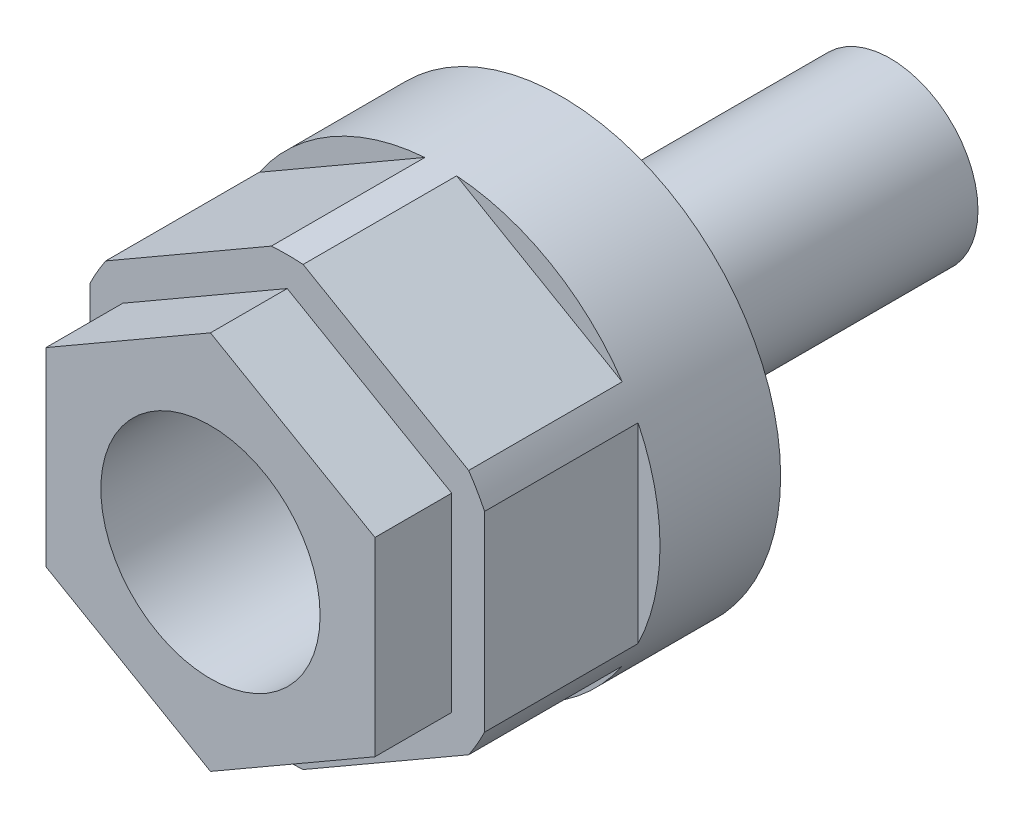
ISO-10303-21;
HEADER;
FILE_DESCRIPTION(('STEP AP214'),'2;1');
FILE_NAME('part.step','',(''),(''),'','','');
FILE_SCHEMA(('AUTOMOTIVE_DESIGN { 1 0 10303 214 1 1 1 1 }'));
ENDSEC;
DATA;
#1=APPLICATION_CONTEXT('core data for automotive mechanical design processes');
#2=APPLICATION_PROTOCOL_DEFINITION('international standard','automotive_design',2000,#1);
#3=PRODUCT_CONTEXT('',#1,'mechanical');
#4=PRODUCT('Part','Part','',(#3));
#5=PRODUCT_RELATED_PRODUCT_CATEGORY('part','',(#4));
#6=PRODUCT_DEFINITION_FORMATION('','',#4);
#7=PRODUCT_DEFINITION_CONTEXT('part definition',#1,'design');
#8=PRODUCT_DEFINITION('design','',#6,#7);
#9=PRODUCT_DEFINITION_SHAPE('','',#8);
#10=(LENGTH_UNIT() NAMED_UNIT(*) SI_UNIT(.MILLI.,.METRE.));
#11=(NAMED_UNIT(*) PLANE_ANGLE_UNIT() SI_UNIT($,.RADIAN.));
#12=(NAMED_UNIT(*) SI_UNIT($,.STERADIAN.) SOLID_ANGLE_UNIT());
#13=UNCERTAINTY_MEASURE_WITH_UNIT(LENGTH_MEASURE(1.E-05),#10,'distance_accuracy_value','');
#14=(GEOMETRIC_REPRESENTATION_CONTEXT(3) GLOBAL_UNCERTAINTY_ASSIGNED_CONTEXT((#13)) GLOBAL_UNIT_ASSIGNED_CONTEXT((#10,
#11,#12)) REPRESENTATION_CONTEXT('',''));
#15=CARTESIAN_POINT('',(0.,0.,0.));
#16=DIRECTION('',(0.,0.,1.));
#17=DIRECTION('',(1.,0.,0.));
#18=AXIS2_PLACEMENT_3D('',#15,#16,#17);
#19=CARTESIAN_POINT('',(0.,0.,80.));
#20=DIRECTION('',(0.,0.,1.));
#21=DIRECTION('',(1.,0.,0.));
#22=AXIS2_PLACEMENT_3D('',#19,#20,#21);
#23=CYLINDRICAL_SURFACE('',#22,20.);
#24=CARTESIAN_POINT('',(0.,0.,0.));
#25=DIRECTION('',(0.,0.,1.));
#26=DIRECTION('',(1.,0.,0.));
#27=AXIS2_PLACEMENT_3D('',#24,#25,#26);
#28=CIRCLE('',#27,20.);
#29=CARTESIAN_POINT('',(20.,0.,0.));
#30=VERTEX_POINT('',#29);
#31=EDGE_CURVE('E216',#30,#30,#28,.T.);
#32=ORIENTED_EDGE('',*,*,#31,.T.);
#33=EDGE_LOOP('',(#32));
#34=FACE_BOUND('',#33,.T.);
#35=DIRECTION('',(0.,0.,1.));
#36=VECTOR('',#35,1.);
#37=CARTESIAN_POINT('',(18.,-8.71779788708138,80.));
#38=LINE('',#37,#36);
#39=CARTESIAN_POINT('',(18.,-8.71779788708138,11.));
#40=VERTEX_POINT('',#39);
#41=CARTESIAN_POINT('',(18.,-8.71779788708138,25.));
#42=VERTEX_POINT('',#41);
#43=EDGE_CURVE('E269',#40,#42,#38,.T.);
#44=ORIENTED_EDGE('',*,*,#43,.T.);
#45=CARTESIAN_POINT('',(0.,0.,25.));
#46=DIRECTION('',(0.,0.,1.));
#47=DIRECTION('',(1.,0.,0.));
#48=AXIS2_PLACEMENT_3D('',#45,#46,#47);
#49=CIRCLE('',#48,20.);
#50=CARTESIAN_POINT('',(16.5498344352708,-11.2295583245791,25.));
#51=VERTEX_POINT('',#50);
#52=EDGE_CURVE('E206',#42,#51,#49,.F.);
#53=ORIENTED_EDGE('',*,*,#52,.T.);
#54=DIRECTION('',(0.,0.,1.));
#55=VECTOR('',#54,1.);
#56=CARTESIAN_POINT('',(16.5498344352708,-11.2295583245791,80.));
#57=LINE('',#56,#55);
#58=CARTESIAN_POINT('',(16.5498344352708,-11.2295583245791,11.));
#59=VERTEX_POINT('',#58);
#60=EDGE_CURVE('E263',#59,#51,#57,.T.);
#61=ORIENTED_EDGE('',*,*,#60,.F.);
#62=CARTESIAN_POINT('',(0.,0.,11.));
#63=DIRECTION('',(0.,0.,1.));
#64=DIRECTION('',(1.,0.,0.));
#65=AXIS2_PLACEMENT_3D('',#62,#63,#64);
#66=CIRCLE('',#65,20.);
#67=CARTESIAN_POINT('',(1.45016556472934,-19.9473562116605,11.));
#68=VERTEX_POINT('',#67);
#69=EDGE_CURVE('E266',#59,#68,#66,.F.);
#70=ORIENTED_EDGE('',*,*,#69,.T.);
#71=DIRECTION('',(0.,0.,1.));
#72=VECTOR('',#71,1.);
#73=CARTESIAN_POINT('',(1.45016556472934,-19.9473562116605,80.));
#74=LINE('',#73,#72);
#75=CARTESIAN_POINT('',(1.45016556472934,-19.9473562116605,25.));
#76=VERTEX_POINT('',#75);
#77=EDGE_CURVE('E267',#76,#68,#74,.F.);
#78=ORIENTED_EDGE('',*,*,#77,.F.);
#79=CARTESIAN_POINT('',(-1.45016556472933,-19.9473562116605,25.));
#80=VERTEX_POINT('',#79);
#81=EDGE_CURVE('E196',#76,#80,#49,.F.);
#82=ORIENTED_EDGE('',*,*,#81,.T.);
#83=DIRECTION('',(0.,0.,1.));
#84=VECTOR('',#83,1.);
#85=CARTESIAN_POINT('',(-1.45016556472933,-19.9473562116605,80.));
#86=LINE('',#85,#84);
#87=CARTESIAN_POINT('',(-1.45016556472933,-19.9473562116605,11.));
#88=VERTEX_POINT('',#87);
#89=EDGE_CURVE('E261',#80,#88,#86,.F.);
#90=ORIENTED_EDGE('',*,*,#89,.T.);
#91=CARTESIAN_POINT('',(-16.5498344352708,-11.2295583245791,11.));
#92=VERTEX_POINT('',#91);
#93=EDGE_CURVE('E260',#88,#92,#66,.F.);
#94=ORIENTED_EDGE('',*,*,#93,.T.);
#95=DIRECTION('',(0.,0.,1.));
#96=VECTOR('',#95,1.);
#97=CARTESIAN_POINT('',(-16.5498344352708,-11.2295583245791,80.));
#98=LINE('',#97,#96);
#99=CARTESIAN_POINT('',(-16.5498344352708,-11.2295583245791,25.));
#100=VERTEX_POINT('',#99);
#101=EDGE_CURVE('E257',#92,#100,#98,.T.);
#102=ORIENTED_EDGE('',*,*,#101,.T.);
#103=CARTESIAN_POINT('',(-18.,-8.71779788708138,25.));
#104=VERTEX_POINT('',#103);
#105=EDGE_CURVE('E208',#100,#104,#49,.F.);
#106=ORIENTED_EDGE('',*,*,#105,.T.);
#107=DIRECTION('',(0.,0.,1.));
#108=VECTOR('',#107,1.);
#109=CARTESIAN_POINT('',(-18.,-8.71779788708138,80.));
#110=LINE('',#109,#108);
#111=CARTESIAN_POINT('',(-18.,-8.71779788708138,11.));
#112=VERTEX_POINT('',#111);
#113=EDGE_CURVE('E252',#112,#104,#110,.T.);
#114=ORIENTED_EDGE('',*,*,#113,.F.);
#115=CARTESIAN_POINT('',(-18.,8.71779788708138,11.));
#116=VERTEX_POINT('',#115);
#117=EDGE_CURVE('E250',#112,#116,#66,.F.);
#118=ORIENTED_EDGE('',*,*,#117,.T.);
#119=DIRECTION('',(0.,0.,1.));
#120=VECTOR('',#119,1.);
#121=CARTESIAN_POINT('',(-18.,8.71779788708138,80.));
#122=LINE('',#121,#120);
#123=CARTESIAN_POINT('',(-18.,8.71779788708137,25.));
#124=VERTEX_POINT('',#123);
#125=EDGE_CURVE('E255',#124,#116,#122,.F.);
#126=ORIENTED_EDGE('',*,*,#125,.F.);
#127=CARTESIAN_POINT('',(-16.5498344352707,11.2295583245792,25.));
#128=VERTEX_POINT('',#127);
#129=EDGE_CURVE('E202',#124,#128,#49,.F.);
#130=ORIENTED_EDGE('',*,*,#129,.T.);
#131=DIRECTION('',(0.,0.,1.));
#132=VECTOR('',#131,1.);
#133=CARTESIAN_POINT('',(-16.5498344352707,11.2295583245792,80.));
#134=LINE('',#133,#132);
#135=CARTESIAN_POINT('',(-16.5498344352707,11.2295583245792,11.));
#136=VERTEX_POINT('',#135);
#137=EDGE_CURVE('E242',#136,#128,#134,.T.);
#138=ORIENTED_EDGE('',*,*,#137,.F.);
#139=CARTESIAN_POINT('',(-1.45016556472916,19.9473562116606,11.));
#140=VERTEX_POINT('',#139);
#141=EDGE_CURVE('E245',#136,#140,#66,.F.);
#142=ORIENTED_EDGE('',*,*,#141,.T.);
#143=DIRECTION('',(0.,0.,1.));
#144=VECTOR('',#143,1.);
#145=CARTESIAN_POINT('',(-1.45016556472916,19.9473562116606,80.));
#146=LINE('',#145,#144);
#147=CARTESIAN_POINT('',(-1.45016556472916,19.9473562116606,25.));
#148=VERTEX_POINT('',#147);
#149=EDGE_CURVE('E248',#148,#140,#146,.F.);
#150=ORIENTED_EDGE('',*,*,#149,.F.);
#151=CARTESIAN_POINT('',(1.45016556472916,19.9473562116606,25.));
#152=VERTEX_POINT('',#151);
#153=EDGE_CURVE('E195',#148,#152,#49,.F.);
#154=ORIENTED_EDGE('',*,*,#153,.T.);
#155=DIRECTION('',(0.,0.,1.));
#156=VECTOR('',#155,1.);
#157=CARTESIAN_POINT('',(1.45016556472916,19.9473562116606,80.));
#158=LINE('',#157,#156);
#159=CARTESIAN_POINT('',(1.45016556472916,19.9473562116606,11.));
#160=VERTEX_POINT('',#159);
#161=EDGE_CURVE('E23',#152,#160,#158,.F.);
#162=ORIENTED_EDGE('',*,*,#161,.T.);
#163=CARTESIAN_POINT('',(16.5498344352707,11.2295583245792,11.));
#164=VERTEX_POINT('',#163);
#165=EDGE_CURVE('E249',#160,#164,#66,.F.);
#166=ORIENTED_EDGE('',*,*,#165,.T.);
#167=DIRECTION('',(0.,0.,1.));
#168=VECTOR('',#167,1.);
#169=CARTESIAN_POINT('',(16.5498344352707,11.2295583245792,80.));
#170=LINE('',#169,#168);
#171=CARTESIAN_POINT('',(16.5498344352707,11.2295583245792,25.));
#172=VERTEX_POINT('',#171);
#173=EDGE_CURVE('E275',#164,#172,#170,.T.);
#174=ORIENTED_EDGE('',*,*,#173,.T.);
#175=CARTESIAN_POINT('',(18.,8.71779788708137,25.));
#176=VERTEX_POINT('',#175);
#177=EDGE_CURVE('E38',#172,#176,#49,.F.);
#178=ORIENTED_EDGE('',*,*,#177,.T.);
#179=DIRECTION('',(0.,0.,1.));
#180=VECTOR('',#179,1.);
#181=CARTESIAN_POINT('',(18.,8.71779788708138,80.));
#182=LINE('',#181,#180);
#183=CARTESIAN_POINT('',(18.,8.71779788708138,11.));
#184=VERTEX_POINT('',#183);
#185=EDGE_CURVE('E273',#176,#184,#182,.F.);
#186=ORIENTED_EDGE('',*,*,#185,.T.);
#187=EDGE_CURVE('E272',#184,#40,#66,.F.);
#188=ORIENTED_EDGE('',*,*,#187,.T.);
#189=EDGE_LOOP('',(#44,#53,#61,#70,#78,#82,#90,#94,#102,#106,#114,#118,#126,#130,#138,#142,#150,
#154,#162,#166,#174,#178,#186,#188));
#190=FACE_BOUND('',#189,.T.);
#191=ADVANCED_FACE('F14',(#34,#190),#23,.T.);
#192=CARTESIAN_POINT('',(-18.,10.3923048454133,11.));
#193=DIRECTION('',(0.5,-0.86602540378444,0.));
#194=DIRECTION('',(0.86602540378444,0.5,0.));
#195=AXIS2_PLACEMENT_3D('',#192,#193,#194);
#196=PLANE('',#195);
#197=DIRECTION('',(-0.86602540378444,-0.5,0.));
#198=VECTOR('',#197,1.);
#199=CARTESIAN_POINT('',(-18.,10.3923048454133,25.));
#200=LINE('',#199,#198);
#201=EDGE_CURVE('E200',#148,#128,#200,.T.);
#202=ORIENTED_EDGE('',*,*,#201,.F.);
#203=ORIENTED_EDGE('',*,*,#149,.T.);
#204=DIRECTION('',(0.86602540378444,0.5,0.));
#205=VECTOR('',#204,1.);
#206=CARTESIAN_POINT('',(-18.,10.3923048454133,11.));
#207=LINE('',#206,#205);
#208=EDGE_CURVE('E226',#136,#140,#207,.T.);
#209=ORIENTED_EDGE('',*,*,#208,.F.);
#210=ORIENTED_EDGE('',*,*,#137,.T.);
#211=EDGE_LOOP('',(#202,#203,#209,#210));
#212=FACE_BOUND('',#211,.T.);
#213=ADVANCED_FACE('F333',(#212),#196,.F.);
#214=CARTESIAN_POINT('',(-18.,-10.3923048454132,11.));
#215=DIRECTION('',(1.,0.,0.));
#216=DIRECTION('',(0.,0.,-1.));
#217=AXIS2_PLACEMENT_3D('',#214,#215,#216);
#218=PLANE('',#217);
#219=DIRECTION('',(0.,-1.,0.));
#220=VECTOR('',#219,1.);
#221=CARTESIAN_POINT('',(-18.,-10.3923048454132,25.));
#222=LINE('',#221,#220);
#223=EDGE_CURVE('E205',#124,#104,#222,.T.);
#224=ORIENTED_EDGE('',*,*,#223,.F.);
#225=ORIENTED_EDGE('',*,*,#125,.T.);
#226=DIRECTION('',(0.,1.,0.));
#227=VECTOR('',#226,1.);
#228=CARTESIAN_POINT('',(-18.,-10.3923048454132,11.));
#229=LINE('',#228,#227);
#230=EDGE_CURVE('E223',#112,#116,#229,.T.);
#231=ORIENTED_EDGE('',*,*,#230,.F.);
#232=ORIENTED_EDGE('',*,*,#113,.T.);
#233=EDGE_LOOP('',(#224,#225,#231,#232));
#234=FACE_BOUND('',#233,.T.);
#235=ADVANCED_FACE('F301',(#234),#218,.F.);
#236=CARTESIAN_POINT('',(-18.,-10.3923048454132,11.));
#237=DIRECTION('',(-0.5,-0.866025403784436,0.));
#238=DIRECTION('',(0.866025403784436,-0.5,0.));
#239=AXIS2_PLACEMENT_3D('',#236,#237,#238);
#240=PLANE('',#239);
#241=ORIENTED_EDGE('',*,*,#89,.F.);
#242=DIRECTION('',(-0.866025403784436,0.5,0.));
#243=VECTOR('',#242,1.);
#244=CARTESIAN_POINT('',(-18.,-10.3923048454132,25.));
#245=LINE('',#244,#243);
#246=EDGE_CURVE('E209',#80,#100,#245,.T.);
#247=ORIENTED_EDGE('',*,*,#246,.T.);
#248=ORIENTED_EDGE('',*,*,#101,.F.);
#249=DIRECTION('',(0.866025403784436,-0.5,0.));
#250=VECTOR('',#249,1.);
#251=CARTESIAN_POINT('',(-18.,-10.3923048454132,11.));
#252=LINE('',#251,#250);
#253=EDGE_CURVE('E220',#92,#88,#252,.T.);
#254=ORIENTED_EDGE('',*,*,#253,.T.);
#255=EDGE_LOOP('',(#241,#247,#248,#254));
#256=FACE_BOUND('',#255,.T.);
#257=ADVANCED_FACE('F398',(#256),#240,.T.);
#258=CARTESIAN_POINT('',(18.,-10.3923048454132,11.));
#259=DIRECTION('',(-0.5,0.866025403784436,0.));
#260=DIRECTION('',(-0.866025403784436,-0.5,0.));
#261=AXIS2_PLACEMENT_3D('',#258,#259,#260);
#262=PLANE('',#261);
#263=DIRECTION('',(0.866025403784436,0.5,0.));
#264=VECTOR('',#263,1.);
#265=CARTESIAN_POINT('',(18.,-10.3923048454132,25.));
#266=LINE('',#265,#264);
#267=EDGE_CURVE('E203',#76,#51,#266,.T.);
#268=ORIENTED_EDGE('',*,*,#267,.F.);
#269=ORIENTED_EDGE('',*,*,#77,.T.);
#270=DIRECTION('',(-0.866025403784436,-0.5,0.));
#271=VECTOR('',#270,1.);
#272=CARTESIAN_POINT('',(18.,-10.3923048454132,11.));
#273=LINE('',#272,#271);
#274=EDGE_CURVE('E217',#59,#68,#273,.T.);
#275=ORIENTED_EDGE('',*,*,#274,.F.);
#276=ORIENTED_EDGE('',*,*,#60,.T.);
#277=EDGE_LOOP('',(#268,#269,#275,#276));
#278=FACE_BOUND('',#277,.T.);
#279=ADVANCED_FACE('F401',(#278),#262,.F.);
#280=CARTESIAN_POINT('',(18.,-10.3923048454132,11.));
#281=DIRECTION('',(1.,0.,0.));
#282=DIRECTION('',(0.,0.,-1.));
#283=AXIS2_PLACEMENT_3D('',#280,#281,#282);
#284=PLANE('',#283);
#285=ORIENTED_EDGE('',*,*,#185,.F.);
#286=DIRECTION('',(0.,-1.,0.));
#287=VECTOR('',#286,1.);
#288=CARTESIAN_POINT('',(18.,-10.3923048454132,25.));
#289=LINE('',#288,#287);
#290=EDGE_CURVE('E197',#176,#42,#289,.T.);
#291=ORIENTED_EDGE('',*,*,#290,.T.);
#292=ORIENTED_EDGE('',*,*,#43,.F.);
#293=DIRECTION('',(0.,1.,0.));
#294=VECTOR('',#293,1.);
#295=CARTESIAN_POINT('',(18.,-10.3923048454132,11.));
#296=LINE('',#295,#294);
#297=EDGE_CURVE('E213',#40,#184,#296,.T.);
#298=ORIENTED_EDGE('',*,*,#297,.T.);
#299=EDGE_LOOP('',(#285,#291,#292,#298));
#300=FACE_BOUND('',#299,.T.);
#301=ADVANCED_FACE('F394',(#300),#284,.T.);
#302=CARTESIAN_POINT('',(18.,10.3923048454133,11.));
#303=DIRECTION('',(0.5,0.86602540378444,0.));
#304=DIRECTION('',(-0.86602540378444,0.5,0.));
#305=AXIS2_PLACEMENT_3D('',#302,#303,#304);
#306=PLANE('',#305);
#307=ORIENTED_EDGE('',*,*,#161,.F.);
#308=DIRECTION('',(0.86602540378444,-0.5,0.));
#309=VECTOR('',#308,1.);
#310=CARTESIAN_POINT('',(18.,10.3923048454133,25.));
#311=LINE('',#310,#309);
#312=EDGE_CURVE('E9',#152,#172,#311,.T.);
#313=ORIENTED_EDGE('',*,*,#312,.T.);
#314=ORIENTED_EDGE('',*,*,#173,.F.);
#315=DIRECTION('',(-0.86602540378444,0.5,0.));
#316=VECTOR('',#315,1.);
#317=CARTESIAN_POINT('',(18.,10.3923048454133,11.));
#318=LINE('',#317,#316);
#319=EDGE_CURVE('E212',#164,#160,#318,.T.);
#320=ORIENTED_EDGE('',*,*,#319,.T.);
#321=EDGE_LOOP('',(#307,#313,#314,#320));
#322=FACE_BOUND('',#321,.T.);
#323=ADVANCED_FACE('F310',(#322),#306,.T.);
#324=CARTESIAN_POINT('',(0.,0.,80.));
#325=DIRECTION('',(0.,0.,1.));
#326=DIRECTION('',(1.,0.,0.));
#327=AXIS2_PLACEMENT_3D('',#324,#325,#326);
#328=CYLINDRICAL_SURFACE('',#327,8.);
#329=CARTESIAN_POINT('',(0.,0.,-30.));
#330=DIRECTION('',(0.,0.,1.));
#331=DIRECTION('',(0.,-1.,0.));
#332=AXIS2_PLACEMENT_3D('',#329,#330,#331);
#333=CIRCLE('',#332,8.);
#334=CARTESIAN_POINT('',(0.,-8.,-30.));
#335=VERTEX_POINT('',#334);
#336=EDGE_CURVE('E18',#335,#335,#333,.F.);
#337=ORIENTED_EDGE('',*,*,#336,.F.);
#338=EDGE_LOOP('',(#337));
#339=FACE_BOUND('',#338,.T.);
#340=CARTESIAN_POINT('',(0.,0.,0.));
#341=DIRECTION('',(0.,0.,1.));
#342=DIRECTION('',(1.,0.,0.));
#343=AXIS2_PLACEMENT_3D('',#340,#341,#342);
#344=CIRCLE('',#343,8.);
#345=CARTESIAN_POINT('',(8.,0.,0.));
#346=VERTEX_POINT('',#345);
#347=EDGE_CURVE('E233',#346,#346,#344,.T.);
#348=ORIENTED_EDGE('',*,*,#347,.F.);
#349=EDGE_LOOP('',(#348));
#350=FACE_BOUND('',#349,.T.);
#351=ADVANCED_FACE('F344',(#339,#350),#328,.T.);
#352=CARTESIAN_POINT('',(20.,0.,0.));
#353=DIRECTION('',(0.,0.,-1.));
#354=DIRECTION('',(-1.,0.,0.));
#355=AXIS2_PLACEMENT_3D('',#352,#353,#354);
#356=PLANE('',#355);
#357=ORIENTED_EDGE('',*,*,#347,.T.);
#358=EDGE_LOOP('',(#357));
#359=FACE_BOUND('',#358,.T.);
#360=ORIENTED_EDGE('',*,*,#31,.F.);
#361=EDGE_LOOP('',(#360));
#362=FACE_BOUND('',#361,.T.);
#363=ADVANCED_FACE('F330',(#359,#362),#356,.T.);
#364=CARTESIAN_POINT('',(0.,0.,11.));
#365=DIRECTION('',(0.,0.,1.));
#366=DIRECTION('',(1.,0.,0.));
#367=AXIS2_PLACEMENT_3D('',#364,#365,#366);
#368=PLANE('',#367);
#369=ORIENTED_EDGE('',*,*,#208,.T.);
#370=ORIENTED_EDGE('',*,*,#141,.F.);
#371=EDGE_LOOP('',(#369,#370));
#372=FACE_BOUND('',#371,.T.);
#373=ADVANCED_FACE('F317',(#372),#368,.T.);
#374=ORIENTED_EDGE('',*,*,#230,.T.);
#375=ORIENTED_EDGE('',*,*,#117,.F.);
#376=EDGE_LOOP('',(#374,#375));
#377=FACE_BOUND('',#376,.T.);
#378=ADVANCED_FACE('F298',(#377),#368,.T.);
#379=ORIENTED_EDGE('',*,*,#253,.F.);
#380=ORIENTED_EDGE('',*,*,#93,.F.);
#381=EDGE_LOOP('',(#379,#380));
#382=FACE_BOUND('',#381,.T.);
#383=ADVANCED_FACE('F416',(#382),#368,.T.);
#384=ORIENTED_EDGE('',*,*,#274,.T.);
#385=ORIENTED_EDGE('',*,*,#69,.F.);
#386=EDGE_LOOP('',(#384,#385));
#387=FACE_BOUND('',#386,.T.);
#388=ADVANCED_FACE('F325',(#387),#368,.T.);
#389=ORIENTED_EDGE('',*,*,#297,.F.);
#390=ORIENTED_EDGE('',*,*,#187,.F.);
#391=EDGE_LOOP('',(#389,#390));
#392=FACE_BOUND('',#391,.T.);
#393=ADVANCED_FACE('F315',(#392),#368,.T.);
#394=ORIENTED_EDGE('',*,*,#319,.F.);
#395=ORIENTED_EDGE('',*,*,#165,.F.);
#396=EDGE_LOOP('',(#394,#395));
#397=FACE_BOUND('',#396,.T.);
#398=ADVANCED_FACE('F313',(#397),#368,.T.);
#399=CARTESIAN_POINT('',(0.,0.,25.));
#400=DIRECTION('',(0.,0.,1.));
#401=DIRECTION('',(1.,0.,0.));
#402=AXIS2_PLACEMENT_3D('',#399,#400,#401);
#403=PLANE('',#402);
#404=ORIENTED_EDGE('',*,*,#81,.F.);
#405=ORIENTED_EDGE('',*,*,#267,.T.);
#406=ORIENTED_EDGE('',*,*,#52,.F.);
#407=ORIENTED_EDGE('',*,*,#290,.F.);
#408=ORIENTED_EDGE('',*,*,#177,.F.);
#409=ORIENTED_EDGE('',*,*,#312,.F.);
#410=ORIENTED_EDGE('',*,*,#153,.F.);
#411=ORIENTED_EDGE('',*,*,#201,.T.);
#412=ORIENTED_EDGE('',*,*,#129,.F.);
#413=ORIENTED_EDGE('',*,*,#223,.T.);
#414=ORIENTED_EDGE('',*,*,#105,.F.);
#415=ORIENTED_EDGE('',*,*,#246,.F.);
#416=EDGE_LOOP('',(#404,#405,#406,#407,#408,#409,#410,#411,#412,#413,#414,#415));
#417=FACE_BOUND('',#416,.T.);
#418=DIRECTION('',(-0.866025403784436,-0.5,0.));
#419=VECTOR('',#418,1.);
#420=CARTESIAN_POINT('',(15.,-8.66025403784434,25.));
#421=LINE('',#420,#419);
#422=CARTESIAN_POINT('',(15.,-8.66025403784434,25.));
#423=VERTEX_POINT('',#422);
#424=CARTESIAN_POINT('',(0.,-17.3205080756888,25.));
#425=VERTEX_POINT('',#424);
#426=EDGE_CURVE('E183',#423,#425,#421,.T.);
#427=ORIENTED_EDGE('',*,*,#426,.T.);
#428=DIRECTION('',(0.866025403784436,-0.5,0.));
#429=VECTOR('',#428,1.);
#430=CARTESIAN_POINT('',(-15.,-8.66025403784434,25.));
#431=LINE('',#430,#429);
#432=CARTESIAN_POINT('',(-15.,-8.66025403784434,25.));
#433=VERTEX_POINT('',#432);
#434=EDGE_CURVE('E147',#433,#425,#431,.T.);
#435=ORIENTED_EDGE('',*,*,#434,.F.);
#436=DIRECTION('',(0.,1.,0.));
#437=VECTOR('',#436,1.);
#438=CARTESIAN_POINT('',(-15.,-8.66025403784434,25.));
#439=LINE('',#438,#437);
#440=CARTESIAN_POINT('',(-15.,8.66025403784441,25.));
#441=VERTEX_POINT('',#440);
#442=EDGE_CURVE('E179',#433,#441,#439,.T.);
#443=ORIENTED_EDGE('',*,*,#442,.T.);
#444=DIRECTION('',(0.866025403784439,0.5,0.));
#445=VECTOR('',#444,1.);
#446=CARTESIAN_POINT('',(-15.,8.66025403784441,25.));
#447=LINE('',#446,#445);
#448=CARTESIAN_POINT('',(0.,17.3205080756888,25.));
#449=VERTEX_POINT('',#448);
#450=EDGE_CURVE('E176',#441,#449,#447,.T.);
#451=ORIENTED_EDGE('',*,*,#450,.T.);
#452=DIRECTION('',(-0.866025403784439,0.5,0.));
#453=VECTOR('',#452,1.);
#454=CARTESIAN_POINT('',(15.,8.66025403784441,25.));
#455=LINE('',#454,#453);
#456=CARTESIAN_POINT('',(15.,8.66025403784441,25.));
#457=VERTEX_POINT('',#456);
#458=EDGE_CURVE('E173',#457,#449,#455,.T.);
#459=ORIENTED_EDGE('',*,*,#458,.F.);
#460=DIRECTION('',(0.,1.,0.));
#461=VECTOR('',#460,1.);
#462=CARTESIAN_POINT('',(15.,-8.66025403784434,25.));
#463=LINE('',#462,#461);
#464=EDGE_CURVE('E170',#423,#457,#463,.T.);
#465=ORIENTED_EDGE('',*,*,#464,.F.);
#466=EDGE_LOOP('',(#427,#435,#443,#451,#459,#465));
#467=FACE_BOUND('',#466,.T.);
#468=ADVANCED_FACE('F302',(#417,#467),#403,.T.);
#469=CARTESIAN_POINT('',(15.,-8.66025403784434,25.));
#470=DIRECTION('',(-0.5,0.866025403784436,0.));
#471=DIRECTION('',(-0.866025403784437,-0.5,0.));
#472=AXIS2_PLACEMENT_3D('',#469,#470,#471);
#473=PLANE('',#472);
#474=DIRECTION('',(0.,0.,1.));
#475=VECTOR('',#474,1.);
#476=CARTESIAN_POINT('',(0.,-17.3205080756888,25.));
#477=LINE('',#476,#475);
#478=CARTESIAN_POINT('',(0.,-17.3205080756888,32.));
#479=VERTEX_POINT('',#478);
#480=EDGE_CURVE('E140',#425,#479,#477,.T.);
#481=ORIENTED_EDGE('',*,*,#480,.F.);
#482=ORIENTED_EDGE('',*,*,#426,.F.);
#483=DIRECTION('',(0.,0.,1.));
#484=VECTOR('',#483,1.);
#485=CARTESIAN_POINT('',(15.,-8.66025403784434,25.));
#486=LINE('',#485,#484);
#487=CARTESIAN_POINT('',(15.,-8.66025403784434,32.));
#488=VERTEX_POINT('',#487);
#489=EDGE_CURVE('E156',#423,#488,#486,.T.);
#490=ORIENTED_EDGE('',*,*,#489,.T.);
#491=DIRECTION('',(-0.866025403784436,-0.5,0.));
#492=VECTOR('',#491,1.);
#493=CARTESIAN_POINT('',(15.,-8.66025403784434,32.));
#494=LINE('',#493,#492);
#495=EDGE_CURVE('E154',#488,#479,#494,.T.);
#496=ORIENTED_EDGE('',*,*,#495,.T.);
#497=EDGE_LOOP('',(#481,#482,#490,#496));
#498=FACE_BOUND('',#497,.T.);
#499=ADVANCED_FACE('F155',(#498),#473,.F.);
#500=CARTESIAN_POINT('',(-15.,-8.66025403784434,25.));
#501=DIRECTION('',(-0.5,-0.866025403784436,0.));
#502=DIRECTION('',(0.866025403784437,-0.5,0.));
#503=AXIS2_PLACEMENT_3D('',#500,#501,#502);
#504=PLANE('',#503);
#505=DIRECTION('',(0.,0.,1.));
#506=VECTOR('',#505,1.);
#507=CARTESIAN_POINT('',(-15.,-8.66025403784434,25.));
#508=LINE('',#507,#506);
#509=CARTESIAN_POINT('',(-15.,-8.66025403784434,32.));
#510=VERTEX_POINT('',#509);
#511=EDGE_CURVE('E151',#433,#510,#508,.T.);
#512=ORIENTED_EDGE('',*,*,#511,.F.);
#513=ORIENTED_EDGE('',*,*,#434,.T.);
#514=ORIENTED_EDGE('',*,*,#480,.T.);
#515=DIRECTION('',(0.866025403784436,-0.5,0.));
#516=VECTOR('',#515,1.);
#517=CARTESIAN_POINT('',(-15.,-8.66025403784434,32.));
#518=LINE('',#517,#516);
#519=EDGE_CURVE('E144',#510,#479,#518,.T.);
#520=ORIENTED_EDGE('',*,*,#519,.F.);
#521=EDGE_LOOP('',(#512,#513,#514,#520));
#522=FACE_BOUND('',#521,.T.);
#523=ADVANCED_FACE('F142',(#522),#504,.T.);
#524=CARTESIAN_POINT('',(-15.,-8.66025403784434,25.));
#525=DIRECTION('',(1.,0.,0.));
#526=DIRECTION('',(0.,0.,-1.));
#527=AXIS2_PLACEMENT_3D('',#524,#525,#526);
#528=PLANE('',#527);
#529=DIRECTION('',(0.,0.,1.));
#530=VECTOR('',#529,1.);
#531=CARTESIAN_POINT('',(-15.,8.66025403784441,25.));
#532=LINE('',#531,#530);
#533=CARTESIAN_POINT('',(-15.,8.66025403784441,32.));
#534=VERTEX_POINT('',#533);
#535=EDGE_CURVE('E191',#441,#534,#532,.T.);
#536=ORIENTED_EDGE('',*,*,#535,.F.);
#537=ORIENTED_EDGE('',*,*,#442,.F.);
#538=ORIENTED_EDGE('',*,*,#511,.T.);
#539=DIRECTION('',(0.,1.,0.));
#540=VECTOR('',#539,1.);
#541=CARTESIAN_POINT('',(-15.,-8.66025403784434,32.));
#542=LINE('',#541,#540);
#543=EDGE_CURVE('E164',#510,#534,#542,.T.);
#544=ORIENTED_EDGE('',*,*,#543,.T.);
#545=EDGE_LOOP('',(#536,#537,#538,#544));
#546=FACE_BOUND('',#545,.T.);
#547=ADVANCED_FACE('F386',(#546),#528,.F.);
#548=CARTESIAN_POINT('',(-15.,8.66025403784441,25.));
#549=DIRECTION('',(0.5,-0.86602540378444,0.));
#550=DIRECTION('',(0.86602540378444,0.5,0.));
#551=AXIS2_PLACEMENT_3D('',#548,#549,#550);
#552=PLANE('',#551);
#553=DIRECTION('',(0.,0.,1.));
#554=VECTOR('',#553,1.);
#555=CARTESIAN_POINT('',(0.,17.3205080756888,25.));
#556=LINE('',#555,#554);
#557=CARTESIAN_POINT('',(0.,17.3205080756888,32.));
#558=VERTEX_POINT('',#557);
#559=EDGE_CURVE('E189',#449,#558,#556,.T.);
#560=ORIENTED_EDGE('',*,*,#559,.F.);
#561=ORIENTED_EDGE('',*,*,#450,.F.);
#562=ORIENTED_EDGE('',*,*,#535,.T.);
#563=DIRECTION('',(0.866025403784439,0.5,0.));
#564=VECTOR('',#563,1.);
#565=CARTESIAN_POINT('',(-15.,8.66025403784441,32.));
#566=LINE('',#565,#564);
#567=EDGE_CURVE('E166',#534,#558,#566,.T.);
#568=ORIENTED_EDGE('',*,*,#567,.T.);
#569=EDGE_LOOP('',(#560,#561,#562,#568));
#570=FACE_BOUND('',#569,.T.);
#571=ADVANCED_FACE('F383',(#570),#552,.F.);
#572=CARTESIAN_POINT('',(15.,8.66025403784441,25.));
#573=DIRECTION('',(0.5,0.866025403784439,0.));
#574=DIRECTION('',(-0.86602540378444,0.5,0.));
#575=AXIS2_PLACEMENT_3D('',#572,#573,#574);
#576=PLANE('',#575);
#577=DIRECTION('',(0.,0.,1.));
#578=VECTOR('',#577,1.);
#579=CARTESIAN_POINT('',(15.,8.66025403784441,25.));
#580=LINE('',#579,#578);
#581=CARTESIAN_POINT('',(15.,8.66025403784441,32.));
#582=VERTEX_POINT('',#581);
#583=EDGE_CURVE('E187',#457,#582,#580,.T.);
#584=ORIENTED_EDGE('',*,*,#583,.F.);
#585=ORIENTED_EDGE('',*,*,#458,.T.);
#586=ORIENTED_EDGE('',*,*,#559,.T.);
#587=DIRECTION('',(-0.866025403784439,0.5,0.));
#588=VECTOR('',#587,1.);
#589=CARTESIAN_POINT('',(15.,8.66025403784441,32.));
#590=LINE('',#589,#588);
#591=EDGE_CURVE('E30',#582,#558,#590,.T.);
#592=ORIENTED_EDGE('',*,*,#591,.F.);
#593=EDGE_LOOP('',(#584,#585,#586,#592));
#594=FACE_BOUND('',#593,.T.);
#595=ADVANCED_FACE('F379',(#594),#576,.T.);
#596=CARTESIAN_POINT('',(15.,-8.66025403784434,25.));
#597=DIRECTION('',(1.,0.,0.));
#598=DIRECTION('',(0.,0.,-1.));
#599=AXIS2_PLACEMENT_3D('',#596,#597,#598);
#600=PLANE('',#599);
#601=ORIENTED_EDGE('',*,*,#464,.T.);
#602=ORIENTED_EDGE('',*,*,#583,.T.);
#603=DIRECTION('',(0.,1.,0.));
#604=VECTOR('',#603,1.);
#605=CARTESIAN_POINT('',(15.,-8.66025403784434,32.));
#606=LINE('',#605,#604);
#607=EDGE_CURVE('E185',#488,#582,#606,.T.);
#608=ORIENTED_EDGE('',*,*,#607,.F.);
#609=ORIENTED_EDGE('',*,*,#489,.F.);
#610=EDGE_LOOP('',(#601,#602,#608,#609));
#611=FACE_BOUND('',#610,.T.);
#612=ADVANCED_FACE('F352',(#611),#600,.T.);
#613=CARTESIAN_POINT('',(10.,0.,6.));
#614=DIRECTION('',(0.,0.,-1.));
#615=DIRECTION('',(-1.,0.,0.));
#616=AXIS2_PLACEMENT_3D('',#613,#614,#615);
#617=PLANE('',#616);
#618=CARTESIAN_POINT('',(0.,0.,6.));
#619=DIRECTION('',(0.,0.,1.));
#620=DIRECTION('',(1.,0.,0.));
#621=AXIS2_PLACEMENT_3D('',#618,#619,#620);
#622=CIRCLE('',#621,10.);
#623=CARTESIAN_POINT('',(10.,0.,6.));
#624=VERTEX_POINT('',#623);
#625=EDGE_CURVE('E236',#624,#624,#622,.T.);
#626=ORIENTED_EDGE('',*,*,#625,.T.);
#627=EDGE_LOOP('',(#626));
#628=FACE_BOUND('',#627,.T.);
#629=ADVANCED_FACE('F349',(#628),#617,.F.);
#630=CARTESIAN_POINT('',(0.,0.,80.));
#631=DIRECTION('',(0.,0.,1.));
#632=DIRECTION('',(1.,0.,0.));
#633=AXIS2_PLACEMENT_3D('',#630,#631,#632);
#634=CYLINDRICAL_SURFACE('',#633,10.);
#635=ORIENTED_EDGE('',*,*,#625,.F.);
#636=EDGE_LOOP('',(#635));
#637=FACE_BOUND('',#636,.T.);
#638=CARTESIAN_POINT('',(0.,0.,32.));
#639=DIRECTION('',(0.,0.,1.));
#640=DIRECTION('',(1.,0.,0.));
#641=AXIS2_PLACEMENT_3D('',#638,#639,#640);
#642=CIRCLE('',#641,10.);
#643=CARTESIAN_POINT('',(10.,0.,32.));
#644=VERTEX_POINT('',#643);
#645=EDGE_CURVE('E239',#644,#644,#642,.T.);
#646=ORIENTED_EDGE('',*,*,#645,.T.);
#647=EDGE_LOOP('',(#646));
#648=FACE_BOUND('',#647,.T.);
#649=ADVANCED_FACE('F351',(#637,#648),#634,.F.);
#650=CARTESIAN_POINT('',(20.,0.,32.));
#651=DIRECTION('',(0.,0.,-1.));
#652=DIRECTION('',(-1.,0.,0.));
#653=AXIS2_PLACEMENT_3D('',#650,#651,#652);
#654=PLANE('',#653);
#655=ORIENTED_EDGE('',*,*,#519,.T.);
#656=ORIENTED_EDGE('',*,*,#495,.F.);
#657=ORIENTED_EDGE('',*,*,#607,.T.);
#658=ORIENTED_EDGE('',*,*,#591,.T.);
#659=ORIENTED_EDGE('',*,*,#567,.F.);
#660=ORIENTED_EDGE('',*,*,#543,.F.);
#661=EDGE_LOOP('',(#655,#656,#657,#658,#659,#660));
#662=FACE_BOUND('',#661,.T.);
#663=ORIENTED_EDGE('',*,*,#645,.F.);
#664=EDGE_LOOP('',(#663));
#665=FACE_BOUND('',#664,.T.);
#666=ADVANCED_FACE('F16',(#662,#665),#654,.F.);
#667=CARTESIAN_POINT('',(-20.,30.,-30.));
#668=DIRECTION('',(0.,0.,1.));
#669=DIRECTION('',(0.,-1.,0.));
#670=AXIS2_PLACEMENT_3D('',#667,#668,#669);
#671=PLANE('',#670);
#672=ORIENTED_EDGE('',*,*,#336,.T.);
#673=EDGE_LOOP('',(#672));
#674=FACE_BOUND('',#673,.T.);
#675=ADVANCED_FACE('F360',(#674),#671,.F.);
#676=CLOSED_SHELL('',(#191,#213,#235,#257,#279,#301,#323,#351,#363,#373,#378,#383,#388,#393,
#398,#468,#499,#523,#547,#571,#595,#612,#629,#649,#666,#675));
#677=MANIFOLD_SOLID_BREP('B1',#676);
#678=ADVANCED_BREP_SHAPE_REPRESENTATION('',(#18,#677),#14);
#679=SHAPE_DEFINITION_REPRESENTATION(#9,#678);
ENDSEC;
END-ISO-10303-21;
